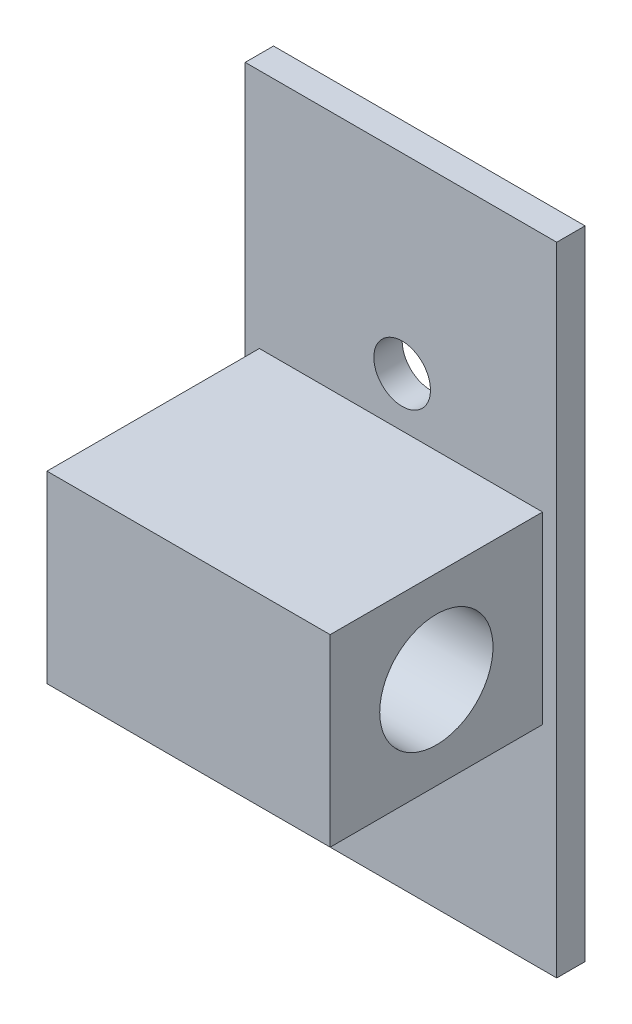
ISO-10303-21;
HEADER;
FILE_DESCRIPTION(('STEP AP214'),'2;1');
FILE_NAME('part.step','',(''),(''),'','','');
FILE_SCHEMA(('AUTOMOTIVE_DESIGN { 1 0 10303 214 1 1 1 1 }'));
ENDSEC;
DATA;
#1=APPLICATION_CONTEXT('core data for automotive mechanical design processes');
#2=APPLICATION_PROTOCOL_DEFINITION('international standard','automotive_design',2000,#1);
#3=PRODUCT_CONTEXT('',#1,'mechanical');
#4=PRODUCT('Part','Part','',(#3));
#5=PRODUCT_RELATED_PRODUCT_CATEGORY('part','',(#4));
#6=PRODUCT_DEFINITION_FORMATION('','',#4);
#7=PRODUCT_DEFINITION_CONTEXT('part definition',#1,'design');
#8=PRODUCT_DEFINITION('design','',#6,#7);
#9=PRODUCT_DEFINITION_SHAPE('','',#8);
#10=(LENGTH_UNIT() NAMED_UNIT(*) SI_UNIT(.MILLI.,.METRE.));
#11=(NAMED_UNIT(*) PLANE_ANGLE_UNIT() SI_UNIT($,.RADIAN.));
#12=(NAMED_UNIT(*) SI_UNIT($,.STERADIAN.) SOLID_ANGLE_UNIT());
#13=UNCERTAINTY_MEASURE_WITH_UNIT(LENGTH_MEASURE(1.E-05),#10,'distance_accuracy_value','');
#14=(GEOMETRIC_REPRESENTATION_CONTEXT(3) GLOBAL_UNCERTAINTY_ASSIGNED_CONTEXT((#13)) GLOBAL_UNIT_ASSIGNED_CONTEXT((#10,
#11,#12)) REPRESENTATION_CONTEXT('',''));
#15=CARTESIAN_POINT('',(0.,0.,0.));
#16=DIRECTION('',(0.,0.,1.));
#17=DIRECTION('',(1.,0.,0.));
#18=AXIS2_PLACEMENT_3D('',#15,#16,#17);
#19=CARTESIAN_POINT('',(0.,0.,15.));
#20=DIRECTION('',(1.,0.,0.));
#21=DIRECTION('',(0.,0.,-1.));
#22=AXIS2_PLACEMENT_3D('',#19,#20,#21);
#23=PLANE('',#22);
#24=CARTESIAN_POINT('',(0.,6.5,7.5));
#25=DIRECTION('',(-1.,0.,0.));
#26=DIRECTION('',(0.,0.,1.));
#27=AXIS2_PLACEMENT_3D('',#24,#25,#26);
#28=CIRCLE('',#27,4.);
#29=CARTESIAN_POINT('',(0.,6.5,11.5));
#30=VERTEX_POINT('',#29);
#31=EDGE_CURVE('E117',#30,#30,#28,.T.);
#32=ORIENTED_EDGE('',*,*,#31,.F.);
#33=EDGE_LOOP('',(#32));
#34=FACE_BOUND('',#33,.T.);
#35=DIRECTION('',(0.,-1.,0.));
#36=VECTOR('',#35,1.);
#37=CARTESIAN_POINT('',(0.,0.,0.));
#38=LINE('',#37,#36);
#39=CARTESIAN_POINT('',(0.,13.,0.));
#40=VERTEX_POINT('',#39);
#41=CARTESIAN_POINT('',(0.,0.,0.));
#42=VERTEX_POINT('',#41);
#43=EDGE_CURVE('E134',#40,#42,#38,.T.);
#44=ORIENTED_EDGE('',*,*,#43,.T.);
#45=DIRECTION('',(0.,0.,-1.));
#46=VECTOR('',#45,1.);
#47=CARTESIAN_POINT('',(0.,0.,15.));
#48=LINE('',#47,#46);
#49=CARTESIAN_POINT('',(0.,0.,15.));
#50=VERTEX_POINT('',#49);
#51=EDGE_CURVE('E11',#50,#42,#48,.T.);
#52=ORIENTED_EDGE('',*,*,#51,.F.);
#53=DIRECTION('',(0.,-1.,0.));
#54=VECTOR('',#53,1.);
#55=CARTESIAN_POINT('',(0.,0.,15.));
#56=LINE('',#55,#54);
#57=CARTESIAN_POINT('',(0.,13.,15.));
#58=VERTEX_POINT('',#57);
#59=EDGE_CURVE('E125',#58,#50,#56,.T.);
#60=ORIENTED_EDGE('',*,*,#59,.F.);
#61=DIRECTION('',(0.,0.,-1.));
#62=VECTOR('',#61,1.);
#63=CARTESIAN_POINT('',(0.,13.,15.));
#64=LINE('',#63,#62);
#65=EDGE_CURVE('E133',#58,#40,#64,.T.);
#66=ORIENTED_EDGE('',*,*,#65,.T.);
#67=EDGE_LOOP('',(#44,#52,#60,#66));
#68=FACE_BOUND('',#67,.T.);
#69=ADVANCED_FACE('F30',(#34,#68),#23,.F.);
#70=CARTESIAN_POINT('',(0.,0.,15.));
#71=DIRECTION('',(0.,1.,0.));
#72=DIRECTION('',(0.,0.,1.));
#73=AXIS2_PLACEMENT_3D('',#70,#71,#72);
#74=PLANE('',#73);
#75=DIRECTION('',(1.,0.,0.));
#76=VECTOR('',#75,1.);
#77=CARTESIAN_POINT('',(0.,0.,0.));
#78=LINE('',#77,#76);
#79=CARTESIAN_POINT('',(20.,0.,0.));
#80=VERTEX_POINT('',#79);
#81=EDGE_CURVE('E137',#42,#80,#78,.T.);
#82=ORIENTED_EDGE('',*,*,#81,.T.);
#83=DIRECTION('',(0.,0.,-1.));
#84=VECTOR('',#83,1.);
#85=CARTESIAN_POINT('',(20.,0.,15.));
#86=LINE('',#85,#84);
#87=CARTESIAN_POINT('',(20.,0.,15.));
#88=VERTEX_POINT('',#87);
#89=EDGE_CURVE('E39',#88,#80,#86,.T.);
#90=ORIENTED_EDGE('',*,*,#89,.F.);
#91=DIRECTION('',(1.,0.,0.));
#92=VECTOR('',#91,1.);
#93=CARTESIAN_POINT('',(0.,0.,15.));
#94=LINE('',#93,#92);
#95=EDGE_CURVE('E127',#50,#88,#94,.T.);
#96=ORIENTED_EDGE('',*,*,#95,.F.);
#97=ORIENTED_EDGE('',*,*,#51,.T.);
#98=EDGE_LOOP('',(#82,#90,#96,#97));
#99=FACE_BOUND('',#98,.T.);
#100=ADVANCED_FACE('F157',(#99),#74,.F.);
#101=CARTESIAN_POINT('',(20.,0.,15.));
#102=DIRECTION('',(-1.,0.,0.));
#103=DIRECTION('',(0.,0.,1.));
#104=AXIS2_PLACEMENT_3D('',#101,#102,#103);
#105=PLANE('',#104);
#106=CARTESIAN_POINT('',(20.,6.5,7.5));
#107=DIRECTION('',(-1.,0.,0.));
#108=DIRECTION('',(0.,0.,1.));
#109=AXIS2_PLACEMENT_3D('',#106,#107,#108);
#110=CIRCLE('',#109,4.);
#111=CARTESIAN_POINT('',(20.,6.5,11.5));
#112=VERTEX_POINT('',#111);
#113=EDGE_CURVE('E33',#112,#112,#110,.T.);
#114=ORIENTED_EDGE('',*,*,#113,.T.);
#115=EDGE_LOOP('',(#114));
#116=FACE_BOUND('',#115,.T.);
#117=DIRECTION('',(0.,1.,0.));
#118=VECTOR('',#117,1.);
#119=CARTESIAN_POINT('',(20.,0.,0.));
#120=LINE('',#119,#118);
#121=CARTESIAN_POINT('',(20.,13.,0.));
#122=VERTEX_POINT('',#121);
#123=EDGE_CURVE('E140',#80,#122,#120,.T.);
#124=ORIENTED_EDGE('',*,*,#123,.T.);
#125=DIRECTION('',(0.,0.,-1.));
#126=VECTOR('',#125,1.);
#127=CARTESIAN_POINT('',(20.,13.,15.));
#128=LINE('',#127,#126);
#129=CARTESIAN_POINT('',(20.,13.,15.));
#130=VERTEX_POINT('',#129);
#131=EDGE_CURVE('E147',#130,#122,#128,.T.);
#132=ORIENTED_EDGE('',*,*,#131,.F.);
#133=DIRECTION('',(0.,1.,0.));
#134=VECTOR('',#133,1.);
#135=CARTESIAN_POINT('',(20.,0.,15.));
#136=LINE('',#135,#134);
#137=EDGE_CURVE('E130',#88,#130,#136,.T.);
#138=ORIENTED_EDGE('',*,*,#137,.F.);
#139=ORIENTED_EDGE('',*,*,#89,.T.);
#140=EDGE_LOOP('',(#124,#132,#138,#139));
#141=FACE_BOUND('',#140,.T.);
#142=ADVANCED_FACE('F154',(#116,#141),#105,.F.);
#143=CARTESIAN_POINT('',(0.,13.,15.));
#144=DIRECTION('',(0.,-1.,0.));
#145=DIRECTION('',(0.,0.,-1.));
#146=AXIS2_PLACEMENT_3D('',#143,#144,#145);
#147=PLANE('',#146);
#148=DIRECTION('',(-1.,0.,0.));
#149=VECTOR('',#148,1.);
#150=CARTESIAN_POINT('',(0.,13.,0.));
#151=LINE('',#150,#149);
#152=EDGE_CURVE('E128',#122,#40,#151,.T.);
#153=ORIENTED_EDGE('',*,*,#152,.T.);
#154=ORIENTED_EDGE('',*,*,#65,.F.);
#155=DIRECTION('',(-1.,0.,0.));
#156=VECTOR('',#155,1.);
#157=CARTESIAN_POINT('',(0.,13.,15.));
#158=LINE('',#157,#156);
#159=EDGE_CURVE('E46',#130,#58,#158,.T.);
#160=ORIENTED_EDGE('',*,*,#159,.F.);
#161=ORIENTED_EDGE('',*,*,#131,.T.);
#162=EDGE_LOOP('',(#153,#154,#160,#161));
#163=FACE_BOUND('',#162,.T.);
#164=ADVANCED_FACE('F163',(#163),#147,.F.);
#165=CARTESIAN_POINT('',(0.,13.,15.));
#166=DIRECTION('',(0.,0.,-1.));
#167=DIRECTION('',(-1.,0.,0.));
#168=AXIS2_PLACEMENT_3D('',#165,#166,#167);
#169=PLANE('',#168);
#170=ORIENTED_EDGE('',*,*,#59,.T.);
#171=ORIENTED_EDGE('',*,*,#95,.T.);
#172=ORIENTED_EDGE('',*,*,#137,.T.);
#173=ORIENTED_EDGE('',*,*,#159,.T.);
#174=EDGE_LOOP('',(#170,#171,#172,#173));
#175=FACE_BOUND('',#174,.T.);
#176=ADVANCED_FACE('F166',(#175),#169,.F.);
#177=CARTESIAN_POINT('',(26.,6.5,7.5));
#178=DIRECTION('',(-1.,0.,0.));
#179=DIRECTION('',(0.,0.,1.));
#180=AXIS2_PLACEMENT_3D('',#177,#178,#179);
#181=CYLINDRICAL_SURFACE('',#180,4.);
#182=CARTESIAN_POINT('',(0.,6.5,11.5));
#183=CARTESIAN_POINT('',(0.208333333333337,6.5,11.5));
#184=CARTESIAN_POINT('',(0.416666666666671,6.5,11.5));
#185=CARTESIAN_POINT('',(0.833333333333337,6.5,11.5));
#186=CARTESIAN_POINT('',(1.04166666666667,6.5,11.5));
#187=CARTESIAN_POINT('',(1.45833333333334,6.5,11.5));
#188=CARTESIAN_POINT('',(1.66666666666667,6.5,11.5));
#189=CARTESIAN_POINT('',(2.08333333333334,6.5,11.5));
#190=CARTESIAN_POINT('',(2.29166666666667,6.5,11.5));
#191=CARTESIAN_POINT('',(2.70833333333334,6.5,11.5));
#192=CARTESIAN_POINT('',(2.91666666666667,6.5,11.5));
#193=CARTESIAN_POINT('',(3.33333333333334,6.5,11.5));
#194=CARTESIAN_POINT('',(3.54166666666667,6.5,11.5));
#195=CARTESIAN_POINT('',(3.95833333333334,6.5,11.5));
#196=CARTESIAN_POINT('',(4.16666666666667,6.5,11.5));
#197=CARTESIAN_POINT('',(4.58333333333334,6.5,11.5));
#198=CARTESIAN_POINT('',(4.79166666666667,6.5,11.5));
#199=CARTESIAN_POINT('',(5.20833333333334,6.5,11.5));
#200=CARTESIAN_POINT('',(5.41666666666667,6.5,11.5));
#201=CARTESIAN_POINT('',(5.83333333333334,6.5,11.5));
#202=CARTESIAN_POINT('',(6.04166666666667,6.5,11.5));
#203=CARTESIAN_POINT('',(6.45833333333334,6.5,11.5));
#204=CARTESIAN_POINT('',(6.66666666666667,6.5,11.5));
#205=CARTESIAN_POINT('',(7.08333333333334,6.5,11.5));
#206=CARTESIAN_POINT('',(7.29166666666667,6.5,11.5));
#207=CARTESIAN_POINT('',(7.70833333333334,6.5,11.5));
#208=CARTESIAN_POINT('',(7.91666666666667,6.5,11.5));
#209=CARTESIAN_POINT('',(8.33333333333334,6.5,11.5));
#210=CARTESIAN_POINT('',(8.54166666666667,6.5,11.5));
#211=CARTESIAN_POINT('',(8.95833333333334,6.5,11.5));
#212=CARTESIAN_POINT('',(9.16666666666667,6.5,11.5));
#213=CARTESIAN_POINT('',(9.58333333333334,6.5,11.5));
#214=CARTESIAN_POINT('',(9.79166666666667,6.5,11.5));
#215=CARTESIAN_POINT('',(10.2083333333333,6.5,11.5));
#216=CARTESIAN_POINT('',(10.4166666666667,6.5,11.5));
#217=CARTESIAN_POINT('',(10.8333333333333,6.5,11.5));
#218=CARTESIAN_POINT('',(11.0416666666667,6.5,11.5));
#219=CARTESIAN_POINT('',(11.4583333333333,6.5,11.5));
#220=CARTESIAN_POINT('',(11.6666666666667,6.5,11.5));
#221=CARTESIAN_POINT('',(12.0833333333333,6.5,11.5));
#222=CARTESIAN_POINT('',(12.2916666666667,6.5,11.5));
#223=CARTESIAN_POINT('',(12.7083333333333,6.5,11.5));
#224=CARTESIAN_POINT('',(12.9166666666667,6.5,11.5));
#225=CARTESIAN_POINT('',(13.3333333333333,6.5,11.5));
#226=CARTESIAN_POINT('',(13.5416666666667,6.5,11.5));
#227=CARTESIAN_POINT('',(13.9583333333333,6.5,11.5));
#228=CARTESIAN_POINT('',(14.1666666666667,6.5,11.5));
#229=CARTESIAN_POINT('',(14.5833333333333,6.5,11.5));
#230=CARTESIAN_POINT('',(14.7916666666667,6.5,11.5));
#231=CARTESIAN_POINT('',(15.2083333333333,6.5,11.5));
#232=CARTESIAN_POINT('',(15.4166666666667,6.5,11.5));
#233=CARTESIAN_POINT('',(15.8333333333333,6.5,11.5));
#234=CARTESIAN_POINT('',(16.0416666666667,6.5,11.5));
#235=CARTESIAN_POINT('',(16.4583333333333,6.5,11.5));
#236=CARTESIAN_POINT('',(16.6666666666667,6.5,11.5));
#237=CARTESIAN_POINT('',(17.0833333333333,6.5,11.5));
#238=CARTESIAN_POINT('',(17.2916666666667,6.5,11.5));
#239=CARTESIAN_POINT('',(17.7083333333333,6.5,11.5));
#240=CARTESIAN_POINT('',(17.9166666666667,6.5,11.5));
#241=CARTESIAN_POINT('',(18.3333333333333,6.5,11.5));
#242=CARTESIAN_POINT('',(18.5416666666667,6.5,11.5));
#243=CARTESIAN_POINT('',(18.9583333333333,6.5,11.5));
#244=CARTESIAN_POINT('',(19.1666666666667,6.5,11.5));
#245=CARTESIAN_POINT('',(19.5833333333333,6.5,11.5));
#246=CARTESIAN_POINT('',(19.7916666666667,6.5,11.5));
#247=CARTESIAN_POINT('',(20.,6.5,11.5));
#248=B_SPLINE_CURVE_WITH_KNOTS('',3,(#182,#183,#184,#185,#186,#187,#188,#189,#190,#191,#192,
#193,#194,#195,#196,#197,#198,#199,#200,#201,#202,#203,#204,#205,#206,#207,#208,#209,#210,#211,
#212,#213,#214,#215,#216,#217,#218,#219,#220,#221,#222,#223,#224,#225,#226,#227,#228,#229,#230,
#231,#232,#233,#234,#235,#236,#237,#238,#239,#240,#241,#242,#243,#244,#245,#246,#247),
.UNSPECIFIED.,.F.,.F.,(4,2,2,2,2,2,2,2,2,2,2,2,2,2,2,2,2,2,2,2,2,2,2,2,2,2,2,2,2,2,2,2,4),(0.,
0.625000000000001,1.25,1.875,2.5,3.125,3.75,4.375,5.,5.625,6.25,6.875,7.5,8.125,8.75,9.375,10.,
10.625,11.25,11.875,12.5,13.125,13.75,14.375,15.,15.625,16.25,16.875,17.5,18.125,18.75,19.375,
20.),.UNSPECIFIED.);
#249=EDGE_CURVE('BSEAM168',#30,#112,#248,.T.);
#250=ORIENTED_EDGE('',*,*,#31,.T.);
#251=ORIENTED_EDGE('',*,*,#113,.F.);
#252=ORIENTED_EDGE('',*,*,#249,.T.);
#253=ORIENTED_EDGE('',*,*,#249,.F.);
#254=EDGE_LOOP('',(#250,#252,#251,#253));
#255=FACE_BOUND('',#254,.T.);
#256=ADVANCED_FACE('F168',(#255),#181,.F.);
#257=CARTESIAN_POINT('',(21.,-15.,0.));
#258=DIRECTION('',(0.,0.,-1.));
#259=DIRECTION('',(-1.,0.,0.));
#260=AXIS2_PLACEMENT_3D('',#257,#258,#259);
#261=PLANE('',#260);
#262=CARTESIAN_POINT('',(10.0844149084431,-3.5,0.));
#263=DIRECTION('',(0.,0.,-1.));
#264=DIRECTION('',(-1.,0.,0.));
#265=AXIS2_PLACEMENT_3D('',#262,#263,#264);
#266=CIRCLE('',#265,2.);
#267=CARTESIAN_POINT('',(8.08441490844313,-3.5,0.));
#268=VERTEX_POINT('',#267);
#269=EDGE_CURVE('E283',#268,#268,#266,.T.);
#270=ORIENTED_EDGE('',*,*,#269,.T.);
#271=EDGE_LOOP('',(#270));
#272=FACE_BOUND('',#271,.T.);
#273=DIRECTION('',(0.,-1.,0.));
#274=VECTOR('',#273,1.);
#275=CARTESIAN_POINT('',(21.,30.,0.));
#276=LINE('',#275,#274);
#277=CARTESIAN_POINT('',(21.,30.,0.));
#278=VERTEX_POINT('',#277);
#279=CARTESIAN_POINT('',(21.,-15.,0.));
#280=VERTEX_POINT('',#279);
#281=EDGE_CURVE('E116',#278,#280,#276,.T.);
#282=ORIENTED_EDGE('',*,*,#281,.F.);
#283=DIRECTION('',(1.,0.,0.));
#284=VECTOR('',#283,1.);
#285=CARTESIAN_POINT('',(21.,30.,0.));
#286=LINE('',#285,#284);
#287=CARTESIAN_POINT('',(-1.,30.,0.));
#288=VERTEX_POINT('',#287);
#289=EDGE_CURVE('E112',#288,#278,#286,.T.);
#290=ORIENTED_EDGE('',*,*,#289,.F.);
#291=DIRECTION('',(0.,1.,0.));
#292=VECTOR('',#291,1.);
#293=CARTESIAN_POINT('',(-1.,30.,0.));
#294=LINE('',#293,#292);
#295=CARTESIAN_POINT('',(-1.00000000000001,-15.,0.));
#296=VERTEX_POINT('',#295);
#297=EDGE_CURVE('E299',#296,#288,#294,.T.);
#298=ORIENTED_EDGE('',*,*,#297,.F.);
#299=DIRECTION('',(-1.,0.,0.));
#300=VECTOR('',#299,1.);
#301=CARTESIAN_POINT('',(21.,-15.,0.));
#302=LINE('',#301,#300);
#303=EDGE_CURVE('E297',#280,#296,#302,.T.);
#304=ORIENTED_EDGE('',*,*,#303,.F.);
#305=EDGE_LOOP('',(#282,#290,#298,#304));
#306=FACE_BOUND('',#305,.T.);
#307=CARTESIAN_POINT('',(10.0844149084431,16.5,0.));
#308=DIRECTION('',(0.,0.,-1.));
#309=DIRECTION('',(-1.,0.,0.));
#310=AXIS2_PLACEMENT_3D('',#307,#308,#309);
#311=CIRCLE('',#310,2.);
#312=CARTESIAN_POINT('',(8.08441490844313,16.5,0.));
#313=VERTEX_POINT('',#312);
#314=EDGE_CURVE('E285',#313,#313,#311,.T.);
#315=ORIENTED_EDGE('',*,*,#314,.T.);
#316=EDGE_LOOP('',(#315));
#317=FACE_BOUND('',#316,.T.);
#318=ORIENTED_EDGE('',*,*,#81,.F.);
#319=ORIENTED_EDGE('',*,*,#43,.F.);
#320=ORIENTED_EDGE('',*,*,#152,.F.);
#321=ORIENTED_EDGE('',*,*,#123,.F.);
#322=EDGE_LOOP('',(#318,#319,#320,#321));
#323=FACE_BOUND('',#322,.T.);
#324=ADVANCED_FACE('F161',(#272,#306,#317,#323),#261,.F.);
#325=CARTESIAN_POINT('',(21.,-15.,-2.));
#326=DIRECTION('',(0.,0.,-1.));
#327=DIRECTION('',(-1.,0.,0.));
#328=AXIS2_PLACEMENT_3D('',#325,#326,#327);
#329=PLANE('',#328);
#330=CARTESIAN_POINT('',(10.0844149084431,16.5,-2.));
#331=DIRECTION('',(0.,0.,-1.));
#332=DIRECTION('',(-1.,0.,0.));
#333=AXIS2_PLACEMENT_3D('',#330,#331,#332);
#334=CIRCLE('',#333,2.);
#335=CARTESIAN_POINT('',(8.08441490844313,16.5,-2.));
#336=VERTEX_POINT('',#335);
#337=EDGE_CURVE('E288',#336,#336,#334,.T.);
#338=ORIENTED_EDGE('',*,*,#337,.F.);
#339=EDGE_LOOP('',(#338));
#340=FACE_BOUND('',#339,.T.);
#341=DIRECTION('',(0.,-1.,0.));
#342=VECTOR('',#341,1.);
#343=CARTESIAN_POINT('',(21.,30.,-2.));
#344=LINE('',#343,#342);
#345=CARTESIAN_POINT('',(21.,30.,-2.));
#346=VERTEX_POINT('',#345);
#347=CARTESIAN_POINT('',(21.,-15.,-2.));
#348=VERTEX_POINT('',#347);
#349=EDGE_CURVE('E102',#346,#348,#344,.T.);
#350=ORIENTED_EDGE('',*,*,#349,.T.);
#351=DIRECTION('',(-1.,0.,0.));
#352=VECTOR('',#351,1.);
#353=CARTESIAN_POINT('',(21.,-15.,-2.));
#354=LINE('',#353,#352);
#355=CARTESIAN_POINT('',(-1.00000000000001,-15.,-2.));
#356=VERTEX_POINT('',#355);
#357=EDGE_CURVE('E91',#348,#356,#354,.T.);
#358=ORIENTED_EDGE('',*,*,#357,.T.);
#359=DIRECTION('',(0.,1.,0.));
#360=VECTOR('',#359,1.);
#361=CARTESIAN_POINT('',(-1.,30.,-2.));
#362=LINE('',#361,#360);
#363=CARTESIAN_POINT('',(-1.,30.,-2.));
#364=VERTEX_POINT('',#363);
#365=EDGE_CURVE('E101',#356,#364,#362,.T.);
#366=ORIENTED_EDGE('',*,*,#365,.T.);
#367=DIRECTION('',(1.,0.,0.));
#368=VECTOR('',#367,1.);
#369=CARTESIAN_POINT('',(21.,30.,-2.));
#370=LINE('',#369,#368);
#371=EDGE_CURVE('E108',#364,#346,#370,.T.);
#372=ORIENTED_EDGE('',*,*,#371,.T.);
#373=EDGE_LOOP('',(#350,#358,#366,#372));
#374=FACE_BOUND('',#373,.T.);
#375=CARTESIAN_POINT('',(10.0844149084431,-3.5,-2.));
#376=DIRECTION('',(0.,0.,-1.));
#377=DIRECTION('',(-1.,0.,0.));
#378=AXIS2_PLACEMENT_3D('',#375,#376,#377);
#379=CIRCLE('',#378,2.);
#380=CARTESIAN_POINT('',(8.08441490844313,-3.5,-2.));
#381=VERTEX_POINT('',#380);
#382=EDGE_CURVE('E280',#381,#381,#379,.T.);
#383=ORIENTED_EDGE('',*,*,#382,.F.);
#384=EDGE_LOOP('',(#383));
#385=FACE_BOUND('',#384,.T.);
#386=ADVANCED_FACE('F105',(#340,#374,#385),#329,.T.);
#387=CARTESIAN_POINT('',(21.,30.,-2.));
#388=DIRECTION('',(-1.,0.,0.));
#389=DIRECTION('',(0.,-1.,0.));
#390=AXIS2_PLACEMENT_3D('',#387,#388,#389);
#391=PLANE('',#390);
#392=ORIENTED_EDGE('',*,*,#281,.T.);
#393=DIRECTION('',(0.,0.,1.));
#394=VECTOR('',#393,1.);
#395=CARTESIAN_POINT('',(21.,-15.,-2.));
#396=LINE('',#395,#394);
#397=EDGE_CURVE('E95',#348,#280,#396,.T.);
#398=ORIENTED_EDGE('',*,*,#397,.F.);
#399=ORIENTED_EDGE('',*,*,#349,.F.);
#400=DIRECTION('',(0.,0.,1.));
#401=VECTOR('',#400,1.);
#402=CARTESIAN_POINT('',(21.,30.,-2.));
#403=LINE('',#402,#401);
#404=EDGE_CURVE('E295',#346,#278,#403,.T.);
#405=ORIENTED_EDGE('',*,*,#404,.T.);
#406=EDGE_LOOP('',(#392,#398,#399,#405));
#407=FACE_BOUND('',#406,.T.);
#408=ADVANCED_FACE('F114',(#407),#391,.F.);
#409=CARTESIAN_POINT('',(21.,-15.,-2.));
#410=DIRECTION('',(0.,1.,0.));
#411=DIRECTION('',(0.,0.,1.));
#412=AXIS2_PLACEMENT_3D('',#409,#410,#411);
#413=PLANE('',#412);
#414=ORIENTED_EDGE('',*,*,#303,.T.);
#415=DIRECTION('',(0.,0.,1.));
#416=VECTOR('',#415,1.);
#417=CARTESIAN_POINT('',(-1.00000000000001,-15.,-2.));
#418=LINE('',#417,#416);
#419=EDGE_CURVE('E98',#356,#296,#418,.T.);
#420=ORIENTED_EDGE('',*,*,#419,.F.);
#421=ORIENTED_EDGE('',*,*,#357,.F.);
#422=ORIENTED_EDGE('',*,*,#397,.T.);
#423=EDGE_LOOP('',(#414,#420,#421,#422));
#424=FACE_BOUND('',#423,.T.);
#425=ADVANCED_FACE('F93',(#424),#413,.F.);
#426=CARTESIAN_POINT('',(-1.,30.,-2.));
#427=DIRECTION('',(1.,0.,0.));
#428=DIRECTION('',(0.,1.,0.));
#429=AXIS2_PLACEMENT_3D('',#426,#427,#428);
#430=PLANE('',#429);
#431=ORIENTED_EDGE('',*,*,#297,.T.);
#432=DIRECTION('',(0.,0.,1.));
#433=VECTOR('',#432,1.);
#434=CARTESIAN_POINT('',(-1.,30.,-2.));
#435=LINE('',#434,#433);
#436=EDGE_CURVE('E121',#364,#288,#435,.T.);
#437=ORIENTED_EDGE('',*,*,#436,.F.);
#438=ORIENTED_EDGE('',*,*,#365,.F.);
#439=ORIENTED_EDGE('',*,*,#419,.T.);
#440=EDGE_LOOP('',(#431,#437,#438,#439));
#441=FACE_BOUND('',#440,.T.);
#442=ADVANCED_FACE('F234',(#441),#430,.F.);
#443=CARTESIAN_POINT('',(21.,30.,-2.));
#444=DIRECTION('',(0.,-1.,0.));
#445=DIRECTION('',(0.,0.,-1.));
#446=AXIS2_PLACEMENT_3D('',#443,#444,#445);
#447=PLANE('',#446);
#448=ORIENTED_EDGE('',*,*,#289,.T.);
#449=ORIENTED_EDGE('',*,*,#404,.F.);
#450=ORIENTED_EDGE('',*,*,#371,.F.);
#451=ORIENTED_EDGE('',*,*,#436,.T.);
#452=EDGE_LOOP('',(#448,#449,#450,#451));
#453=FACE_BOUND('',#452,.T.);
#454=ADVANCED_FACE('F243',(#453),#447,.F.);
#455=CARTESIAN_POINT('',(10.0844149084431,16.5,-2.));
#456=DIRECTION('',(0.,0.,1.));
#457=DIRECTION('',(1.,0.,0.));
#458=AXIS2_PLACEMENT_3D('',#455,#456,#457);
#459=CYLINDRICAL_SURFACE('',#458,2.);
#460=ORIENTED_EDGE('',*,*,#337,.T.);
#461=EDGE_LOOP('',(#460));
#462=FACE_BOUND('',#461,.T.);
#463=ORIENTED_EDGE('',*,*,#314,.F.);
#464=EDGE_LOOP('',(#463));
#465=FACE_BOUND('',#464,.T.);
#466=ADVANCED_FACE('F253',(#462,#465),#459,.F.);
#467=CARTESIAN_POINT('',(10.0844149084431,-3.5,-2.));
#468=DIRECTION('',(0.,0.,1.));
#469=DIRECTION('',(1.,0.,0.));
#470=AXIS2_PLACEMENT_3D('',#467,#468,#469);
#471=CYLINDRICAL_SURFACE('',#470,2.);
#472=ORIENTED_EDGE('',*,*,#382,.T.);
#473=EDGE_LOOP('',(#472));
#474=FACE_BOUND('',#473,.T.);
#475=ORIENTED_EDGE('',*,*,#269,.F.);
#476=EDGE_LOOP('',(#475));
#477=FACE_BOUND('',#476,.T.);
#478=ADVANCED_FACE('F263',(#474,#477),#471,.F.);
#479=CLOSED_SHELL('',(#69,#100,#142,#164,#176,#256,#324,#386,#408,#425,#442,#454,#466,#478));
#480=MANIFOLD_SOLID_BREP('B2',#479);
#481=ADVANCED_BREP_SHAPE_REPRESENTATION('',(#18,#480),#14);
#482=SHAPE_DEFINITION_REPRESENTATION(#9,#481);
ENDSEC;
END-ISO-10303-21;
